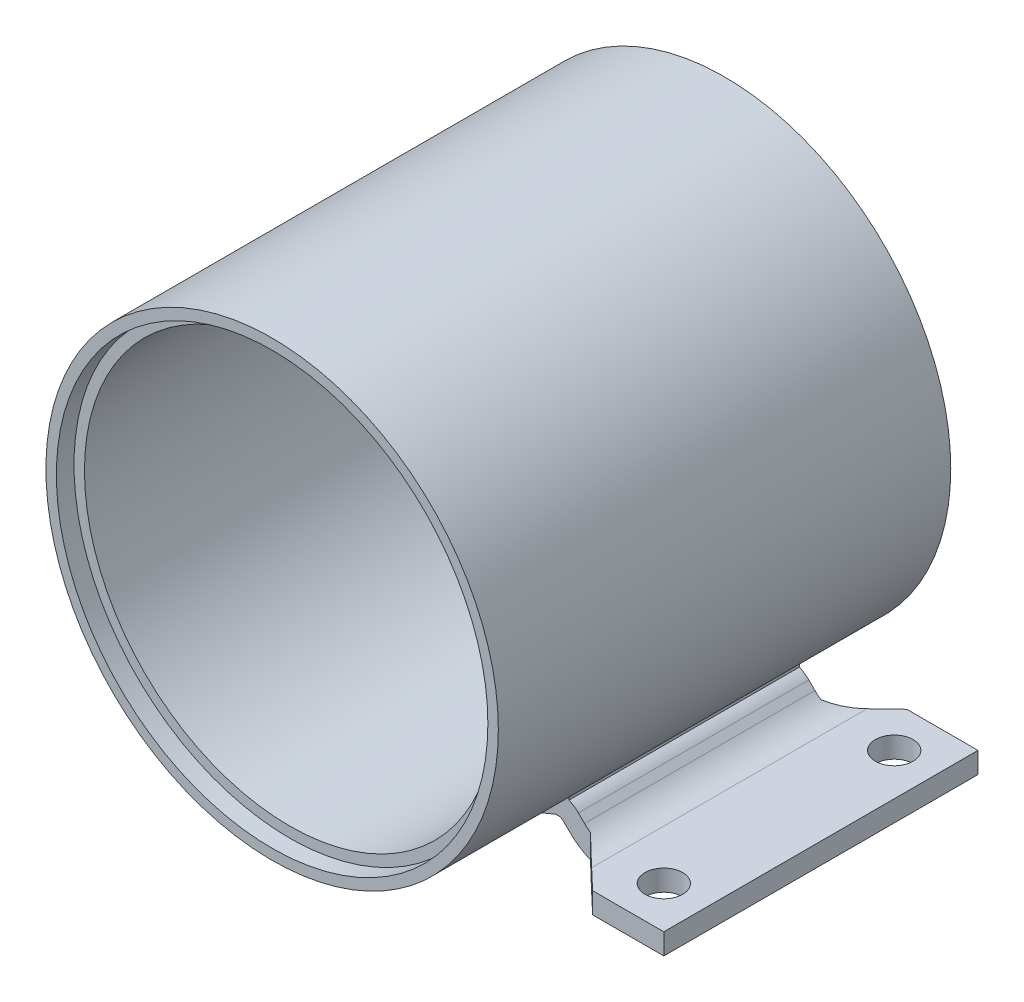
from build123d import *

# Parameters (mm, degrees)
ESQUISSE1_R                  = 54
ESQUISSE1_R_2                = 49
EXTRUSION1_DEPTH             = 108
ESQUISSE2_R                  = 51.5
ENL_V_MAT_EXTRU_1_DEPTH      = 4.2
ENL_V_START                  = -4.2
ESQUISSE3_R                  = 51.5
ENL_V_MAT_EXTRU_2_DEPTH      = 4.2
ESQUISSE4_W                  = 13.403361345
ESQUISSE4_H                  = 3
ENL_V_MAT_EXTRU_3_DEPTH      = 4.2
EXTRUSION2_DEPTH             = 75
ENL_V_MAT_EXTRU_4_REACH      = 170.286
ENL_V_MAT_EXTRU_4_END_RADIUS = 54
EXTRUSION3_DEPTH             = 55
ESQUISSE8_R                  = 4.5
ENL_V_MAT_EXTRU_5_DEPTH      = 5


with BuildPart() as part:
    # Esquisse1 → Extrusion1 (new body)
    with BuildSketch(Plane.XY):
        Circle(ESQUISSE1_R)
        Circle(ESQUISSE1_R_2, mode=Mode.SUBTRACT)
    extrude(amount=EXTRUSION1_DEPTH)

    # Esquisse2 → Enl_v. mat.-Extru.1 (cut)
    with BuildSketch(Plane.XY.offset(108)):
        Circle(ESQUISSE2_R)
    extrude(amount=-ENL_V_MAT_EXTRU_1_DEPTH, mode=Mode.SUBTRACT)

    # Esquisse3 → Enl_v. mat.-Extru.2 (cut)
    with BuildSketch(Plane(origin=(0, 0, 0), x_dir=(-1, 0, 0), z_dir=(0, 0, -1)).offset(ENL_V_START)):
        with Locations(Location((0, 0, 0), (0, 0, 180))):
            Circle(ESQUISSE3_R)
    extrude(amount=ENL_V_MAT_EXTRU_2_DEPTH, mode=Mode.SUBTRACT)

    # Esquisse4 → Enl_v. mat.-Extru.3 (cut)
    with BuildSketch(Plane(origin=(0, 0, 0), x_dir=(-1, 0, 0), z_dir=(0, 0, -1))):
        with Locations((51.37955182, 0)):
            Rectangle(ESQUISSE4_W, ESQUISSE4_H)
    extrude(amount=-ENL_V_MAT_EXTRU_3_DEPTH, mode=Mode.SUBTRACT)

    # Esquisse5 → Extrusion2 (add)
    with BuildSketch(Plane(origin=(0, 0, 0), x_dir=(-1, 0, 0), z_dir=(0, 0, -1))):
        with BuildLine():
            Line((-60.5, -60), (-38.642135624, -60))
            ThreePointArc((-38.642135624, -60), (-32.901884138, -58.858192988), (-28.035533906, -55.606601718))
            Line((-28.035533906, -55.606601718), (-26.581131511, -54.152199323))
            ThreePointArc((-26.581131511, -54.152199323), (-25.525097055, -53.598747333), (-24.341773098, -53.744563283))
            ThreePointArc((-24.341773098, -53.744563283), (0, -59), (24.341773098, -53.744563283))
            ThreePointArc((24.341773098, -53.744563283), (25.525097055, -53.598747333), (26.581131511, -54.152199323))
            Line((26.581131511, -54.152199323), (28.035533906, -55.606601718))
            ThreePointArc((28.035533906, -55.606601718), (32.901884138, -58.858192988), (38.642135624, -60))
            Line((38.642135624, -60), (60.5, -60))
            Line((60.5, -60), (60.5, -55))
            Line((60.5, -55), (38.642135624, -55))
            ThreePointArc((38.642135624, -55), (34.8153013, -54.238795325), (31.571067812, -52.071067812))
            Line((31.571067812, -52.071067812), (30.116665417, -50.616665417))
            ThreePointArc((30.116665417, -50.616665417), (26.42054482, -48.67958345), (22.278910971, -49.189939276))
            ThreePointArc((22.278910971, -49.189939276), (0, -54), (-22.278910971, -49.189939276))
            ThreePointArc((-22.278910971, -49.189939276), (-26.42054482, -48.67958345), (-30.116665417, -50.616665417))
            Line((-30.116665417, -50.616665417), (-31.571067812, -52.071067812))
            ThreePointArc((-31.571067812, -52.071067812), (-34.8153013, -54.238795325), (-38.642135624, -55))
            Line((-38.642135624, -55), (-60.5, -55))
            Line((-60.5, -55), (-60.5, -60))
        make_face()
    extrude(amount=-EXTRUSION2_DEPTH)

    # Enl_v. mat.-Extru.4: up to this cylinder (the profile starts outside it)
    enl_v_mat_extru_4_end = Plane(origin=(0, 0, 37.5), z_dir=(0, 0, -1)) * Cylinder(ENL_V_MAT_EXTRU_4_END_RADIUS, 515.029516, mode=Mode.PRIVATE)
    # Esquisse6 → Enl_v. mat.-Extru.4 (cut, up to the surface)
    with BuildSketch(Plane.XZ.offset(60), mode=Mode.PRIVATE) as enl_v_mat_extru_4_sk1:
        Polygon((43.5, 0), (-43.5, 0), (-33, 10), (33, 10), align=None)
    enl_v_mat_extru_4_tool1 = extrude(enl_v_mat_extru_4_sk1.sketch, amount=-ENL_V_MAT_EXTRU_4_REACH, mode=Mode.PRIVATE) - enl_v_mat_extru_4_end
    add(enl_v_mat_extru_4_tool1.solids().sort_by_distance((0, -60, 4.771242))[0], mode=Mode.SUBTRACT)
    # Esquisse6 → Enl_v. mat.-Extru.4 (cut, up to the surface)
    with BuildSketch(Plane.XZ.offset(60), mode=Mode.PRIVATE) as enl_v_mat_extru_4_sk2:
        Polygon((-33, 65), (-43.5, 75), (43.5, 75), (33, 65), align=None)
    enl_v_mat_extru_4_tool2 = extrude(enl_v_mat_extru_4_sk2.sketch, amount=-ENL_V_MAT_EXTRU_4_REACH, mode=Mode.PRIVATE) - enl_v_mat_extru_4_end
    add(enl_v_mat_extru_4_tool2.solids().sort_by_distance((0, -60, 70.228758))[0], mode=Mode.SUBTRACT)

    # Esquisse7 → Extrusion3 (add)
    with BuildSketch(Plane(origin=(0, 0, 10), x_dir=(-1, 0, 0), z_dir=(0, 0, -1))):
        with BuildLine():
            Line((27.857974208, -46.259412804), (27.857974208, -49.104353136))
            ThreePointArc((27.857974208, -49.104353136), (25.059546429, -48.567236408), (22.278910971, -49.189939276))
            ThreePointArc((22.278910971, -49.189939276), (25.111228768, -47.806131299), (27.857974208, -46.259412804))
        make_face()
        with BuildLine():
            Line((-27.857974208, -46.259412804), (-27.857974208, -49.104353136))
            ThreePointArc((-27.857974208, -49.104353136), (-25.059546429, -48.567236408), (-22.278910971, -49.189939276))
            ThreePointArc((-22.278910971, -49.189939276), (-25.111228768, -47.806131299), (-27.857974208, -46.259412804))
        make_face()
    extrude(amount=-EXTRUSION3_DEPTH)

    # Esquisse8 → Enl_v. mat.-Extru.5 (cut)
    with BuildSketch(Plane.XZ.offset(60)):
        with Locations((50.5, 10)):
            Circle(ESQUISSE8_R)
        with Locations((-50.5, 10)):
            Circle(ESQUISSE8_R)
        with Locations((-50.5, 65)):
            Circle(ESQUISSE8_R)
        with Locations((50.5, 65)):
            Circle(ESQUISSE8_R)
    extrude(amount=-ENL_V_MAT_EXTRU_5_DEPTH, mode=Mode.SUBTRACT)


solid = part.part
